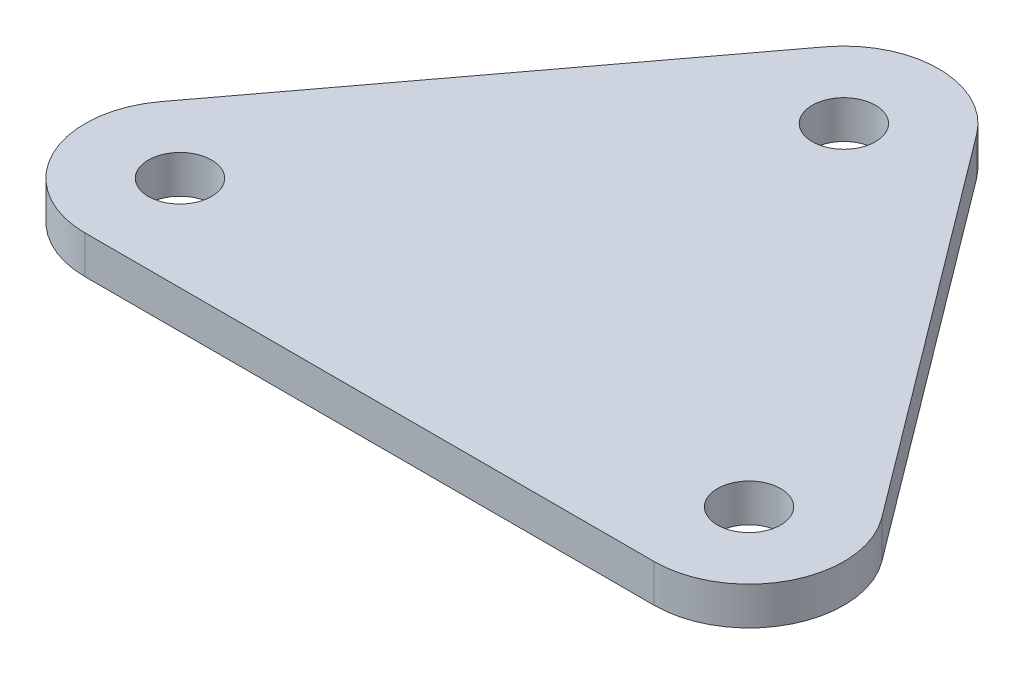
ISO-10303-21;
HEADER;
FILE_DESCRIPTION(('STEP AP214'),'2;1');
FILE_NAME('part.step','',(''),(''),'','','');
FILE_SCHEMA(('AUTOMOTIVE_DESIGN { 1 0 10303 214 1 1 1 1 }'));
ENDSEC;
DATA;
#1=APPLICATION_CONTEXT('core data for automotive mechanical design processes');
#2=APPLICATION_PROTOCOL_DEFINITION('international standard','automotive_design',2000,#1);
#3=PRODUCT_CONTEXT('',#1,'mechanical');
#4=PRODUCT('Part','Part','',(#3));
#5=PRODUCT_RELATED_PRODUCT_CATEGORY('part','',(#4));
#6=PRODUCT_DEFINITION_FORMATION('','',#4);
#7=PRODUCT_DEFINITION_CONTEXT('part definition',#1,'design');
#8=PRODUCT_DEFINITION('design','',#6,#7);
#9=PRODUCT_DEFINITION_SHAPE('','',#8);
#10=(LENGTH_UNIT() NAMED_UNIT(*) SI_UNIT(.MILLI.,.METRE.));
#11=(NAMED_UNIT(*) PLANE_ANGLE_UNIT() SI_UNIT($,.RADIAN.));
#12=(NAMED_UNIT(*) SI_UNIT($,.STERADIAN.) SOLID_ANGLE_UNIT());
#13=UNCERTAINTY_MEASURE_WITH_UNIT(LENGTH_MEASURE(1.E-05),#10,'distance_accuracy_value','');
#14=(GEOMETRIC_REPRESENTATION_CONTEXT(3) GLOBAL_UNCERTAINTY_ASSIGNED_CONTEXT((#13)) GLOBAL_UNIT_ASSIGNED_CONTEXT((#10,
#11,#12)) REPRESENTATION_CONTEXT('',''));
#15=CARTESIAN_POINT('',(0.,0.,0.));
#16=DIRECTION('',(0.,0.,1.));
#17=DIRECTION('',(1.,0.,0.));
#18=AXIS2_PLACEMENT_3D('',#15,#16,#17);
#19=CARTESIAN_POINT('',(0.,0.,0.));
#20=DIRECTION('',(0.,1.,0.));
#21=DIRECTION('',(0.,0.,1.));
#22=AXIS2_PLACEMENT_3D('',#19,#20,#21);
#23=PLANE('',#22);
#24=CARTESIAN_POINT('',(22.5,0.,-10.));
#25=DIRECTION('',(0.,-1.,0.));
#26=DIRECTION('',(0.,0.,-1.));
#27=AXIS2_PLACEMENT_3D('',#24,#25,#26);
#28=CIRCLE('',#27,2.5);
#29=CARTESIAN_POINT('',(22.5,0.,-12.5));
#30=VERTEX_POINT('',#29);
#31=EDGE_CURVE('E116',#30,#30,#28,.F.);
#32=ORIENTED_EDGE('',*,*,#31,.T.);
#33=EDGE_LOOP('',(#32));
#34=FACE_BOUND('',#33,.T.);
#35=CARTESIAN_POINT('',(0.,0.,-40.));
#36=DIRECTION('',(0.,-1.,0.));
#37=DIRECTION('',(0.,0.,-1.));
#38=AXIS2_PLACEMENT_3D('',#35,#36,#37);
#39=CIRCLE('',#38,2.5);
#40=CARTESIAN_POINT('',(0.,0.,-42.5));
#41=VERTEX_POINT('',#40);
#42=EDGE_CURVE('E91',#41,#41,#39,.F.);
#43=ORIENTED_EDGE('',*,*,#42,.T.);
#44=EDGE_LOOP('',(#43));
#45=FACE_BOUND('',#44,.T.);
#46=CARTESIAN_POINT('',(-22.5,0.,-10.));
#47=DIRECTION('',(0.,-1.,0.));
#48=DIRECTION('',(0.,0.,-1.));
#49=AXIS2_PLACEMENT_3D('',#46,#47,#48);
#50=CIRCLE('',#49,2.5);
#51=CARTESIAN_POINT('',(-22.5,0.,-12.5));
#52=VERTEX_POINT('',#51);
#53=EDGE_CURVE('E88',#52,#52,#50,.F.);
#54=ORIENTED_EDGE('',*,*,#53,.T.);
#55=EDGE_LOOP('',(#54));
#56=FACE_BOUND('',#55,.T.);
#57=DIRECTION('',(0.6,0.,-0.8));
#58=VECTOR('',#57,1.);
#59=CARTESIAN_POINT('',(-25.2,0.,-18.9));
#60=LINE('',#59,#58);
#61=CARTESIAN_POINT('',(-28.5,0.,-14.5));
#62=VERTEX_POINT('',#61);
#63=CARTESIAN_POINT('',(-6.,0.,-44.5));
#64=VERTEX_POINT('',#63);
#65=EDGE_CURVE('E71',#62,#64,#60,.T.);
#66=ORIENTED_EDGE('',*,*,#65,.T.);
#67=CARTESIAN_POINT('',(0.,0.,-40.));
#68=DIRECTION('',(0.,-1.,0.));
#69=DIRECTION('',(0.,0.,-1.));
#70=AXIS2_PLACEMENT_3D('',#67,#68,#69);
#71=CIRCLE('',#70,7.5);
#72=CARTESIAN_POINT('',(6.,0.,-44.5));
#73=VERTEX_POINT('',#72);
#74=EDGE_CURVE('E121',#73,#64,#71,.F.);
#75=ORIENTED_EDGE('',*,*,#74,.F.);
#76=DIRECTION('',(-0.6,0.,-0.8));
#77=VECTOR('',#76,1.);
#78=CARTESIAN_POINT('',(25.2,0.,-18.9));
#79=LINE('',#78,#77);
#80=CARTESIAN_POINT('',(28.5,0.,-14.5));
#81=VERTEX_POINT('',#80);
#82=EDGE_CURVE('E96',#81,#73,#79,.T.);
#83=ORIENTED_EDGE('',*,*,#82,.F.);
#84=CARTESIAN_POINT('',(22.5,0.,-10.));
#85=DIRECTION('',(0.,-1.,0.));
#86=DIRECTION('',(0.,0.,-1.));
#87=AXIS2_PLACEMENT_3D('',#84,#85,#86);
#88=CIRCLE('',#87,7.5);
#89=CARTESIAN_POINT('',(22.5,0.,-2.5));
#90=VERTEX_POINT('',#89);
#91=EDGE_CURVE('E101',#90,#81,#88,.F.);
#92=ORIENTED_EDGE('',*,*,#91,.F.);
#93=DIRECTION('',(-1.,0.,0.));
#94=VECTOR('',#93,1.);
#95=CARTESIAN_POINT('',(0.,0.,-2.5));
#96=LINE('',#95,#94);
#97=CARTESIAN_POINT('',(-22.5,0.,-2.5));
#98=VERTEX_POINT('',#97);
#99=EDGE_CURVE('E74',#90,#98,#96,.T.);
#100=ORIENTED_EDGE('',*,*,#99,.T.);
#101=CARTESIAN_POINT('',(-22.5,0.,-10.));
#102=DIRECTION('',(0.,-1.,0.));
#103=DIRECTION('',(0.,0.,-1.));
#104=AXIS2_PLACEMENT_3D('',#101,#102,#103);
#105=CIRCLE('',#104,7.5);
#106=EDGE_CURVE('E20',#62,#98,#105,.F.);
#107=ORIENTED_EDGE('',*,*,#106,.F.);
#108=EDGE_LOOP('',(#66,#75,#83,#92,#100,#107));
#109=FACE_BOUND('',#108,.T.);
#110=ADVANCED_FACE('F17',(#34,#45,#56,#109),#23,.F.);
#111=CARTESIAN_POINT('',(-22.5,3.,-10.));
#112=DIRECTION('',(0.,-1.,0.));
#113=DIRECTION('',(0.,0.,-1.));
#114=AXIS2_PLACEMENT_3D('',#111,#112,#113);
#115=CYLINDRICAL_SURFACE('',#114,7.5);
#116=CARTESIAN_POINT('',(-22.5,3.,-10.));
#117=DIRECTION('',(0.,-1.,0.));
#118=DIRECTION('',(0.,0.,-1.));
#119=AXIS2_PLACEMENT_3D('',#116,#117,#118);
#120=CIRCLE('',#119,7.5);
#121=CARTESIAN_POINT('',(-28.5,3.,-14.5));
#122=VERTEX_POINT('',#121);
#123=CARTESIAN_POINT('',(-22.5,3.,-2.5));
#124=VERTEX_POINT('',#123);
#125=EDGE_CURVE('E82',#122,#124,#120,.F.);
#126=ORIENTED_EDGE('',*,*,#125,.F.);
#127=DIRECTION('',(0.,1.,0.));
#128=VECTOR('',#127,1.);
#129=CARTESIAN_POINT('',(-28.5,3.,-14.5));
#130=LINE('',#129,#128);
#131=EDGE_CURVE('E79',#122,#62,#130,.F.);
#132=ORIENTED_EDGE('',*,*,#131,.T.);
#133=ORIENTED_EDGE('',*,*,#106,.T.);
#134=DIRECTION('',(0.,1.,0.));
#135=VECTOR('',#134,1.);
#136=CARTESIAN_POINT('',(-22.5,3.,-2.5));
#137=LINE('',#136,#135);
#138=EDGE_CURVE('E77',#98,#124,#137,.T.);
#139=ORIENTED_EDGE('',*,*,#138,.T.);
#140=EDGE_LOOP('',(#126,#132,#133,#139));
#141=FACE_BOUND('',#140,.T.);
#142=ADVANCED_FACE('F80',(#141),#115,.T.);
#143=CARTESIAN_POINT('',(0.,3.,-2.5));
#144=DIRECTION('',(0.,0.,-1.));
#145=DIRECTION('',(-1.,0.,0.));
#146=AXIS2_PLACEMENT_3D('',#143,#144,#145);
#147=PLANE('',#146);
#148=DIRECTION('',(0.,-1.,0.));
#149=VECTOR('',#148,1.);
#150=CARTESIAN_POINT('',(22.5,3.,-2.5));
#151=LINE('',#150,#149);
#152=CARTESIAN_POINT('',(22.5,3.,-2.5));
#153=VERTEX_POINT('',#152);
#154=EDGE_CURVE('E100',#153,#90,#151,.T.);
#155=ORIENTED_EDGE('',*,*,#154,.F.);
#156=DIRECTION('',(1.,0.,0.));
#157=VECTOR('',#156,1.);
#158=CARTESIAN_POINT('',(0.,3.,-2.5));
#159=LINE('',#158,#157);
#160=EDGE_CURVE('E114',#124,#153,#159,.T.);
#161=ORIENTED_EDGE('',*,*,#160,.F.);
#162=ORIENTED_EDGE('',*,*,#138,.F.);
#163=ORIENTED_EDGE('',*,*,#99,.F.);
#164=EDGE_LOOP('',(#155,#161,#162,#163));
#165=FACE_BOUND('',#164,.T.);
#166=ADVANCED_FACE('F139',(#165),#147,.F.);
#167=CARTESIAN_POINT('',(22.5,3.,-10.));
#168=DIRECTION('',(0.,-1.,0.));
#169=DIRECTION('',(0.,0.,-1.));
#170=AXIS2_PLACEMENT_3D('',#167,#168,#169);
#171=CYLINDRICAL_SURFACE('',#170,7.5);
#172=CARTESIAN_POINT('',(22.5,3.,-10.));
#173=DIRECTION('',(0.,-1.,0.));
#174=DIRECTION('',(0.,0.,-1.));
#175=AXIS2_PLACEMENT_3D('',#172,#173,#174);
#176=CIRCLE('',#175,7.5);
#177=CARTESIAN_POINT('',(28.5,3.,-14.5));
#178=VERTEX_POINT('',#177);
#179=EDGE_CURVE('E111',#153,#178,#176,.F.);
#180=ORIENTED_EDGE('',*,*,#179,.F.);
#181=ORIENTED_EDGE('',*,*,#154,.T.);
#182=ORIENTED_EDGE('',*,*,#91,.T.);
#183=DIRECTION('',(0.,1.,0.));
#184=VECTOR('',#183,1.);
#185=CARTESIAN_POINT('',(28.5,3.,-14.5));
#186=LINE('',#185,#184);
#187=EDGE_CURVE('E99',#178,#81,#186,.F.);
#188=ORIENTED_EDGE('',*,*,#187,.F.);
#189=EDGE_LOOP('',(#180,#181,#182,#188));
#190=FACE_BOUND('',#189,.T.);
#191=ADVANCED_FACE('F140',(#190),#171,.T.);
#192=CARTESIAN_POINT('',(25.2,3.,-18.9));
#193=DIRECTION('',(0.8,0.,-0.6));
#194=DIRECTION('',(-0.6,0.,-0.8));
#195=AXIS2_PLACEMENT_3D('',#192,#193,#194);
#196=PLANE('',#195);
#197=DIRECTION('',(-0.6,0.,-0.8));
#198=VECTOR('',#197,1.);
#199=CARTESIAN_POINT('',(28.5,3.,-14.5));
#200=LINE('',#199,#198);
#201=CARTESIAN_POINT('',(6.,3.,-44.5));
#202=VERTEX_POINT('',#201);
#203=EDGE_CURVE('E110',#178,#202,#200,.T.);
#204=ORIENTED_EDGE('',*,*,#203,.F.);
#205=ORIENTED_EDGE('',*,*,#187,.T.);
#206=ORIENTED_EDGE('',*,*,#82,.T.);
#207=DIRECTION('',(0.,-1.,0.));
#208=VECTOR('',#207,1.);
#209=CARTESIAN_POINT('',(6.,3.,-44.5));
#210=LINE('',#209,#208);
#211=EDGE_CURVE('E122',#202,#73,#210,.T.);
#212=ORIENTED_EDGE('',*,*,#211,.F.);
#213=EDGE_LOOP('',(#204,#205,#206,#212));
#214=FACE_BOUND('',#213,.T.);
#215=ADVANCED_FACE('F143',(#214),#196,.T.);
#216=CARTESIAN_POINT('',(0.,3.,-40.));
#217=DIRECTION('',(0.,-1.,0.));
#218=DIRECTION('',(0.,0.,-1.));
#219=AXIS2_PLACEMENT_3D('',#216,#217,#218);
#220=CYLINDRICAL_SURFACE('',#219,7.5);
#221=ORIENTED_EDGE('',*,*,#74,.T.);
#222=DIRECTION('',(0.,1.,0.));
#223=VECTOR('',#222,1.);
#224=CARTESIAN_POINT('',(-6.,3.,-44.5));
#225=LINE('',#224,#223);
#226=CARTESIAN_POINT('',(-6.,3.,-44.5));
#227=VERTEX_POINT('',#226);
#228=EDGE_CURVE('E85',#64,#227,#225,.T.);
#229=ORIENTED_EDGE('',*,*,#228,.T.);
#230=CARTESIAN_POINT('',(0.,3.,-40.));
#231=DIRECTION('',(0.,-1.,0.));
#232=DIRECTION('',(0.,0.,-1.));
#233=AXIS2_PLACEMENT_3D('',#230,#231,#232);
#234=CIRCLE('',#233,7.5);
#235=EDGE_CURVE('E35',#202,#227,#234,.F.);
#236=ORIENTED_EDGE('',*,*,#235,.F.);
#237=ORIENTED_EDGE('',*,*,#211,.T.);
#238=EDGE_LOOP('',(#221,#229,#236,#237));
#239=FACE_BOUND('',#238,.T.);
#240=ADVANCED_FACE('F145',(#239),#220,.T.);
#241=CARTESIAN_POINT('',(-25.2,3.,-18.9));
#242=DIRECTION('',(0.8,0.,0.6));
#243=DIRECTION('',(0.6,0.,-0.8));
#244=AXIS2_PLACEMENT_3D('',#241,#242,#243);
#245=PLANE('',#244);
#246=ORIENTED_EDGE('',*,*,#131,.F.);
#247=DIRECTION('',(-0.6,0.,0.8));
#248=VECTOR('',#247,1.);
#249=CARTESIAN_POINT('',(-6.,3.,-44.5));
#250=LINE('',#249,#248);
#251=EDGE_CURVE('E108',#227,#122,#250,.T.);
#252=ORIENTED_EDGE('',*,*,#251,.F.);
#253=ORIENTED_EDGE('',*,*,#228,.F.);
#254=ORIENTED_EDGE('',*,*,#65,.F.);
#255=EDGE_LOOP('',(#246,#252,#253,#254));
#256=FACE_BOUND('',#255,.T.);
#257=ADVANCED_FACE('F87',(#256),#245,.F.);
#258=CARTESIAN_POINT('',(-22.5,3.,-10.));
#259=DIRECTION('',(0.,-1.,0.));
#260=DIRECTION('',(0.,0.,-1.));
#261=AXIS2_PLACEMENT_3D('',#258,#259,#260);
#262=CYLINDRICAL_SURFACE('',#261,2.5);
#263=CARTESIAN_POINT('',(-22.5,3.,-10.));
#264=DIRECTION('',(0.,-1.,0.));
#265=DIRECTION('',(0.,0.,-1.));
#266=AXIS2_PLACEMENT_3D('',#263,#264,#265);
#267=CIRCLE('',#266,2.5);
#268=CARTESIAN_POINT('',(-22.5,3.,-12.5));
#269=VERTEX_POINT('',#268);
#270=EDGE_CURVE('E105',#269,#269,#267,.T.);
#271=ORIENTED_EDGE('',*,*,#270,.F.);
#272=EDGE_LOOP('',(#271));
#273=FACE_BOUND('',#272,.T.);
#274=ORIENTED_EDGE('',*,*,#53,.F.);
#275=EDGE_LOOP('',(#274));
#276=FACE_BOUND('',#275,.T.);
#277=ADVANCED_FACE('F153',(#273,#276),#262,.F.);
#278=CARTESIAN_POINT('',(0.,3.,-40.));
#279=DIRECTION('',(0.,-1.,0.));
#280=DIRECTION('',(0.,0.,-1.));
#281=AXIS2_PLACEMENT_3D('',#278,#279,#280);
#282=CYLINDRICAL_SURFACE('',#281,2.5);
#283=CARTESIAN_POINT('',(0.,3.,-40.));
#284=DIRECTION('',(0.,-1.,0.));
#285=DIRECTION('',(0.,0.,-1.));
#286=AXIS2_PLACEMENT_3D('',#283,#284,#285);
#287=CIRCLE('',#286,2.5);
#288=CARTESIAN_POINT('',(0.,3.,-42.5));
#289=VERTEX_POINT('',#288);
#290=EDGE_CURVE('E26',#289,#289,#287,.T.);
#291=ORIENTED_EDGE('',*,*,#290,.F.);
#292=EDGE_LOOP('',(#291));
#293=FACE_BOUND('',#292,.T.);
#294=ORIENTED_EDGE('',*,*,#42,.F.);
#295=EDGE_LOOP('',(#294));
#296=FACE_BOUND('',#295,.T.);
#297=ADVANCED_FACE('F163',(#293,#296),#282,.F.);
#298=CARTESIAN_POINT('',(22.5,3.,-10.));
#299=DIRECTION('',(0.,-1.,0.));
#300=DIRECTION('',(0.,0.,-1.));
#301=AXIS2_PLACEMENT_3D('',#298,#299,#300);
#302=CYLINDRICAL_SURFACE('',#301,2.5);
#303=CARTESIAN_POINT('',(22.5,3.,-10.));
#304=DIRECTION('',(0.,-1.,0.));
#305=DIRECTION('',(0.,0.,-1.));
#306=AXIS2_PLACEMENT_3D('',#303,#304,#305);
#307=CIRCLE('',#306,2.5);
#308=CARTESIAN_POINT('',(22.5,3.,-12.5));
#309=VERTEX_POINT('',#308);
#310=EDGE_CURVE('E11',#309,#309,#307,.T.);
#311=ORIENTED_EDGE('',*,*,#310,.F.);
#312=EDGE_LOOP('',(#311));
#313=FACE_BOUND('',#312,.T.);
#314=ORIENTED_EDGE('',*,*,#31,.F.);
#315=EDGE_LOOP('',(#314));
#316=FACE_BOUND('',#315,.T.);
#317=ADVANCED_FACE('F157',(#313,#316),#302,.F.);
#318=CARTESIAN_POINT('',(0.,3.,0.));
#319=DIRECTION('',(0.,1.,0.));
#320=DIRECTION('',(0.,0.,1.));
#321=AXIS2_PLACEMENT_3D('',#318,#319,#320);
#322=PLANE('',#321);
#323=ORIENTED_EDGE('',*,*,#310,.T.);
#324=EDGE_LOOP('',(#323));
#325=FACE_BOUND('',#324,.T.);
#326=ORIENTED_EDGE('',*,*,#290,.T.);
#327=EDGE_LOOP('',(#326));
#328=FACE_BOUND('',#327,.T.);
#329=ORIENTED_EDGE('',*,*,#270,.T.);
#330=EDGE_LOOP('',(#329));
#331=FACE_BOUND('',#330,.T.);
#332=ORIENTED_EDGE('',*,*,#235,.T.);
#333=ORIENTED_EDGE('',*,*,#251,.T.);
#334=ORIENTED_EDGE('',*,*,#125,.T.);
#335=ORIENTED_EDGE('',*,*,#160,.T.);
#336=ORIENTED_EDGE('',*,*,#179,.T.);
#337=ORIENTED_EDGE('',*,*,#203,.T.);
#338=EDGE_LOOP('',(#332,#333,#334,#335,#336,#337));
#339=FACE_BOUND('',#338,.T.);
#340=ADVANCED_FACE('F136',(#325,#328,#331,#339),#322,.T.);
#341=CLOSED_SHELL('',(#110,#142,#166,#191,#215,#240,#257,#277,#297,#317,#340));
#342=MANIFOLD_SOLID_BREP('B1',#341);
#343=ADVANCED_BREP_SHAPE_REPRESENTATION('',(#18,#342),#14);
#344=SHAPE_DEFINITION_REPRESENTATION(#9,#343);
ENDSEC;
END-ISO-10303-21;
